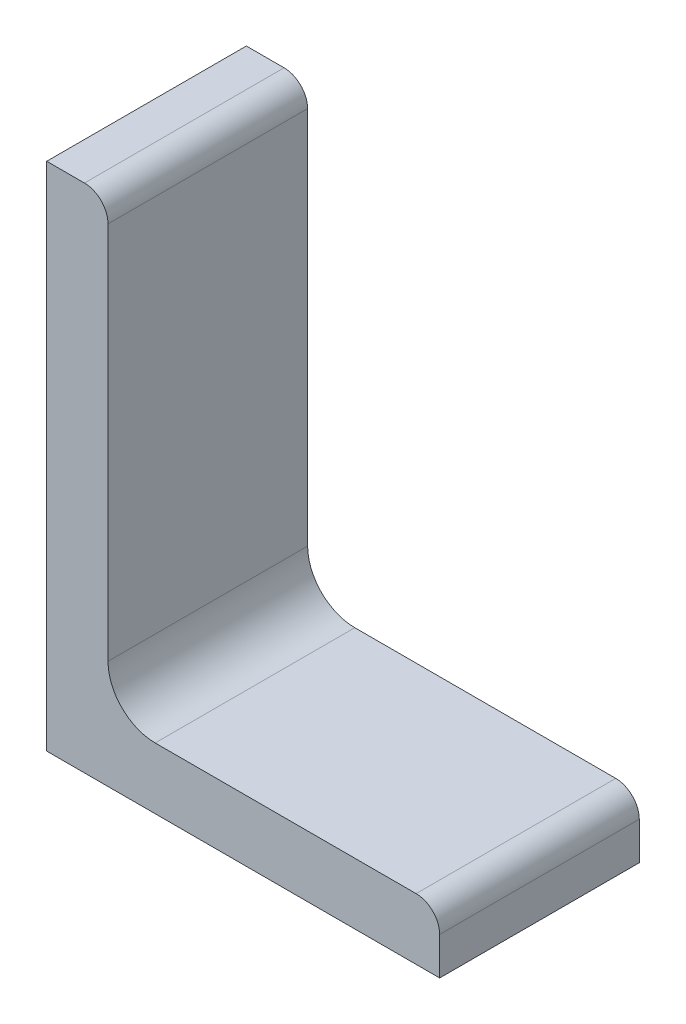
ISO-10303-21;
HEADER;
FILE_DESCRIPTION(('STEP AP214'),'2;1');
FILE_NAME('part.step','',(''),(''),'','','');
FILE_SCHEMA(('AUTOMOTIVE_DESIGN { 1 0 10303 214 1 1 1 1 }'));
ENDSEC;
DATA;
#1=APPLICATION_CONTEXT('core data for automotive mechanical design processes');
#2=APPLICATION_PROTOCOL_DEFINITION('international standard','automotive_design',2000,#1);
#3=PRODUCT_CONTEXT('',#1,'mechanical');
#4=PRODUCT('Part','Part','',(#3));
#5=PRODUCT_RELATED_PRODUCT_CATEGORY('part','',(#4));
#6=PRODUCT_DEFINITION_FORMATION('','',#4);
#7=PRODUCT_DEFINITION_CONTEXT('part definition',#1,'design');
#8=PRODUCT_DEFINITION('design','',#6,#7);
#9=PRODUCT_DEFINITION_SHAPE('','',#8);
#10=(LENGTH_UNIT() NAMED_UNIT(*) SI_UNIT(.MILLI.,.METRE.));
#11=(NAMED_UNIT(*) PLANE_ANGLE_UNIT() SI_UNIT($,.RADIAN.));
#12=(NAMED_UNIT(*) SI_UNIT($,.STERADIAN.) SOLID_ANGLE_UNIT());
#13=UNCERTAINTY_MEASURE_WITH_UNIT(LENGTH_MEASURE(1.E-05),#10,'distance_accuracy_value','');
#14=(GEOMETRIC_REPRESENTATION_CONTEXT(3) GLOBAL_UNCERTAINTY_ASSIGNED_CONTEXT((#13)) GLOBAL_UNIT_ASSIGNED_CONTEXT((#10,
#11,#12)) REPRESENTATION_CONTEXT('',''));
#15=CARTESIAN_POINT('',(0.,0.,0.));
#16=DIRECTION('',(0.,0.,1.));
#17=DIRECTION('',(1.,0.,0.));
#18=AXIS2_PLACEMENT_3D('',#15,#16,#17);
#19=CARTESIAN_POINT('',(0.,0.,12.7));
#20=DIRECTION('',(1.,0.,0.));
#21=DIRECTION('',(0.,0.,-1.));
#22=AXIS2_PLACEMENT_3D('',#19,#20,#21);
#23=PLANE('',#22);
#24=DIRECTION('',(0.,-1.,0.));
#25=VECTOR('',#24,1.);
#26=CARTESIAN_POINT('',(0.,0.,-12.7));
#27=LINE('',#26,#25);
#28=CARTESIAN_POINT('',(0.,65.,-12.7));
#29=VERTEX_POINT('',#28);
#30=CARTESIAN_POINT('',(0.,0.,-12.7));
#31=VERTEX_POINT('',#30);
#32=EDGE_CURVE('E134',#29,#31,#27,.T.);
#33=ORIENTED_EDGE('',*,*,#32,.T.);
#34=DIRECTION('',(0.,0.,-1.));
#35=VECTOR('',#34,1.);
#36=CARTESIAN_POINT('',(0.,0.,12.7));
#37=LINE('',#36,#35);
#38=CARTESIAN_POINT('',(0.,0.,12.7));
#39=VERTEX_POINT('',#38);
#40=EDGE_CURVE('E11',#39,#31,#37,.T.);
#41=ORIENTED_EDGE('',*,*,#40,.F.);
#42=DIRECTION('',(0.,-1.,0.));
#43=VECTOR('',#42,1.);
#44=CARTESIAN_POINT('',(0.,0.,12.7));
#45=LINE('',#44,#43);
#46=CARTESIAN_POINT('',(0.,65.,12.7));
#47=VERTEX_POINT('',#46);
#48=EDGE_CURVE('E150',#47,#39,#45,.T.);
#49=ORIENTED_EDGE('',*,*,#48,.F.);
#50=DIRECTION('',(0.,0.,-1.));
#51=VECTOR('',#50,1.);
#52=CARTESIAN_POINT('',(0.,65.,12.7));
#53=LINE('',#52,#51);
#54=EDGE_CURVE('E130',#47,#29,#53,.T.);
#55=ORIENTED_EDGE('',*,*,#54,.T.);
#56=EDGE_LOOP('',(#33,#41,#49,#55));
#57=FACE_BOUND('',#56,.T.);
#58=ADVANCED_FACE('F32',(#57),#23,.F.);
#59=CARTESIAN_POINT('',(0.,0.,12.7));
#60=DIRECTION('',(0.,1.,0.));
#61=DIRECTION('',(0.,0.,1.));
#62=AXIS2_PLACEMENT_3D('',#59,#60,#61);
#63=PLANE('',#62);
#64=DIRECTION('',(1.,0.,0.));
#65=VECTOR('',#64,1.);
#66=CARTESIAN_POINT('',(0.,0.,-12.7));
#67=LINE('',#66,#65);
#68=CARTESIAN_POINT('',(50.,0.,-12.7));
#69=VERTEX_POINT('',#68);
#70=EDGE_CURVE('E137',#31,#69,#67,.T.);
#71=ORIENTED_EDGE('',*,*,#70,.T.);
#72=DIRECTION('',(0.,0.,-1.));
#73=VECTOR('',#72,1.);
#74=CARTESIAN_POINT('',(50.,0.,12.7));
#75=LINE('',#74,#73);
#76=CARTESIAN_POINT('',(50.,0.,12.7));
#77=VERTEX_POINT('',#76);
#78=EDGE_CURVE('E40',#77,#69,#75,.T.);
#79=ORIENTED_EDGE('',*,*,#78,.F.);
#80=DIRECTION('',(1.,0.,0.));
#81=VECTOR('',#80,1.);
#82=CARTESIAN_POINT('',(0.,0.,12.7));
#83=LINE('',#82,#81);
#84=EDGE_CURVE('E94',#39,#77,#83,.T.);
#85=ORIENTED_EDGE('',*,*,#84,.F.);
#86=ORIENTED_EDGE('',*,*,#40,.T.);
#87=EDGE_LOOP('',(#71,#79,#85,#86));
#88=FACE_BOUND('',#87,.T.);
#89=ADVANCED_FACE('F193',(#88),#63,.F.);
#90=CARTESIAN_POINT('',(50.,0.,12.7));
#91=DIRECTION('',(-1.,0.,0.));
#92=DIRECTION('',(0.,0.,1.));
#93=AXIS2_PLACEMENT_3D('',#90,#91,#92);
#94=PLANE('',#93);
#95=DIRECTION('',(0.,1.,0.));
#96=VECTOR('',#95,1.);
#97=CARTESIAN_POINT('',(50.,0.,-12.7));
#98=LINE('',#97,#96);
#99=CARTESIAN_POINT('',(50.,4.8,-12.7));
#100=VERTEX_POINT('',#99);
#101=EDGE_CURVE('E139',#69,#100,#98,.T.);
#102=ORIENTED_EDGE('',*,*,#101,.T.);
#103=DIRECTION('',(0.,0.,-1.));
#104=VECTOR('',#103,1.);
#105=CARTESIAN_POINT('',(50.,4.8,12.7));
#106=LINE('',#105,#104);
#107=CARTESIAN_POINT('',(50.,4.8,12.7));
#108=VERTEX_POINT('',#107);
#109=EDGE_CURVE('E160',#108,#100,#106,.T.);
#110=ORIENTED_EDGE('',*,*,#109,.F.);
#111=DIRECTION('',(0.,1.,0.));
#112=VECTOR('',#111,1.);
#113=CARTESIAN_POINT('',(50.,0.,12.7));
#114=LINE('',#113,#112);
#115=EDGE_CURVE('E168',#77,#108,#114,.T.);
#116=ORIENTED_EDGE('',*,*,#115,.F.);
#117=ORIENTED_EDGE('',*,*,#78,.T.);
#118=EDGE_LOOP('',(#102,#110,#116,#117));
#119=FACE_BOUND('',#118,.T.);
#120=ADVANCED_FACE('F166',(#119),#94,.F.);
#121=CARTESIAN_POINT('',(47.,4.8,12.7));
#122=DIRECTION('',(0.,0.,-1.));
#123=DIRECTION('',(-1.,0.,0.));
#124=AXIS2_PLACEMENT_3D('',#121,#122,#123);
#125=CYLINDRICAL_SURFACE('',#124,3.);
#126=CARTESIAN_POINT('',(47.,4.8,-12.7));
#127=DIRECTION('',(0.,0.,1.));
#128=DIRECTION('',(1.,0.,0.));
#129=AXIS2_PLACEMENT_3D('',#126,#127,#128);
#130=CIRCLE('',#129,3.);
#131=CARTESIAN_POINT('',(47.,7.8,-12.7));
#132=VERTEX_POINT('',#131);
#133=EDGE_CURVE('E141',#100,#132,#130,.T.);
#134=ORIENTED_EDGE('',*,*,#133,.T.);
#135=DIRECTION('',(0.,0.,-1.));
#136=VECTOR('',#135,1.);
#137=CARTESIAN_POINT('',(47.,7.8,12.7));
#138=LINE('',#137,#136);
#139=CARTESIAN_POINT('',(47.,7.8,12.7));
#140=VERTEX_POINT('',#139);
#141=EDGE_CURVE('E157',#140,#132,#138,.T.);
#142=ORIENTED_EDGE('',*,*,#141,.F.);
#143=CARTESIAN_POINT('',(47.,4.8,12.7));
#144=DIRECTION('',(0.,0.,1.));
#145=DIRECTION('',(1.,0.,0.));
#146=AXIS2_PLACEMENT_3D('',#143,#144,#145);
#147=CIRCLE('',#146,3.);
#148=EDGE_CURVE('E184',#108,#140,#147,.T.);
#149=ORIENTED_EDGE('',*,*,#148,.F.);
#150=ORIENTED_EDGE('',*,*,#109,.T.);
#151=EDGE_LOOP('',(#134,#142,#149,#150));
#152=FACE_BOUND('',#151,.T.);
#153=ADVANCED_FACE('F177',(#152),#125,.T.);
#154=CARTESIAN_POINT('',(13.8,7.8,12.7));
#155=DIRECTION('',(0.,-1.,0.));
#156=DIRECTION('',(1.,0.,0.));
#157=AXIS2_PLACEMENT_3D('',#154,#155,#156);
#158=PLANE('',#157);
#159=DIRECTION('',(-1.,0.,0.));
#160=VECTOR('',#159,1.);
#161=CARTESIAN_POINT('',(13.8,7.8,-12.7));
#162=LINE('',#161,#160);
#163=CARTESIAN_POINT('',(13.8,7.8,-12.7));
#164=VERTEX_POINT('',#163);
#165=EDGE_CURVE('E143',#132,#164,#162,.T.);
#166=ORIENTED_EDGE('',*,*,#165,.T.);
#167=DIRECTION('',(0.,0.,-1.));
#168=VECTOR('',#167,1.);
#169=CARTESIAN_POINT('',(13.8,7.8,12.7));
#170=LINE('',#169,#168);
#171=CARTESIAN_POINT('',(13.8,7.8,12.7));
#172=VERTEX_POINT('',#171);
#173=EDGE_CURVE('E154',#172,#164,#170,.T.);
#174=ORIENTED_EDGE('',*,*,#173,.F.);
#175=DIRECTION('',(-1.,0.,0.));
#176=VECTOR('',#175,1.);
#177=CARTESIAN_POINT('',(13.8,7.8,12.7));
#178=LINE('',#177,#176);
#179=EDGE_CURVE('E183',#140,#172,#178,.T.);
#180=ORIENTED_EDGE('',*,*,#179,.F.);
#181=ORIENTED_EDGE('',*,*,#141,.T.);
#182=EDGE_LOOP('',(#166,#174,#180,#181));
#183=FACE_BOUND('',#182,.T.);
#184=ADVANCED_FACE('F181',(#183),#158,.F.);
#185=CARTESIAN_POINT('',(13.8,13.8,12.7));
#186=DIRECTION('',(0.,0.,-1.));
#187=DIRECTION('',(-1.,0.,0.));
#188=AXIS2_PLACEMENT_3D('',#185,#186,#187);
#189=CYLINDRICAL_SURFACE('',#188,6.);
#190=CARTESIAN_POINT('',(13.8,13.8,-12.7));
#191=DIRECTION('',(0.,0.,-1.));
#192=DIRECTION('',(1.,0.,0.));
#193=AXIS2_PLACEMENT_3D('',#190,#191,#192);
#194=CIRCLE('',#193,6.);
#195=CARTESIAN_POINT('',(7.80000000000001,13.8,-12.7));
#196=VERTEX_POINT('',#195);
#197=EDGE_CURVE('E145',#164,#196,#194,.T.);
#198=ORIENTED_EDGE('',*,*,#197,.T.);
#199=DIRECTION('',(0.,0.,-1.));
#200=VECTOR('',#199,1.);
#201=CARTESIAN_POINT('',(7.80000000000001,13.8,12.7));
#202=LINE('',#201,#200);
#203=CARTESIAN_POINT('',(7.80000000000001,13.8,12.7));
#204=VERTEX_POINT('',#203);
#205=EDGE_CURVE('E125',#204,#196,#202,.T.);
#206=ORIENTED_EDGE('',*,*,#205,.F.);
#207=CARTESIAN_POINT('',(13.8,13.8,12.7));
#208=DIRECTION('',(0.,0.,-1.));
#209=DIRECTION('',(1.,0.,0.));
#210=AXIS2_PLACEMENT_3D('',#207,#208,#209);
#211=CIRCLE('',#210,6.);
#212=EDGE_CURVE('E116',#172,#204,#211,.T.);
#213=ORIENTED_EDGE('',*,*,#212,.F.);
#214=ORIENTED_EDGE('',*,*,#173,.T.);
#215=EDGE_LOOP('',(#198,#206,#213,#214));
#216=FACE_BOUND('',#215,.T.);
#217=ADVANCED_FACE('F205',(#216),#189,.F.);
#218=CARTESIAN_POINT('',(7.8,62.,12.7));
#219=DIRECTION('',(-1.,0.,0.));
#220=DIRECTION('',(0.,-1.,0.));
#221=AXIS2_PLACEMENT_3D('',#218,#219,#220);
#222=PLANE('',#221);
#223=DIRECTION('',(0.,1.,0.));
#224=VECTOR('',#223,1.);
#225=CARTESIAN_POINT('',(7.8,62.,-12.7));
#226=LINE('',#225,#224);
#227=CARTESIAN_POINT('',(7.8,62.,-12.7));
#228=VERTEX_POINT('',#227);
#229=EDGE_CURVE('E124',#196,#228,#226,.T.);
#230=ORIENTED_EDGE('',*,*,#229,.T.);
#231=DIRECTION('',(0.,0.,-1.));
#232=VECTOR('',#231,1.);
#233=CARTESIAN_POINT('',(7.8,62.,12.7));
#234=LINE('',#233,#232);
#235=CARTESIAN_POINT('',(7.8,62.,12.7));
#236=VERTEX_POINT('',#235);
#237=EDGE_CURVE('E121',#236,#228,#234,.T.);
#238=ORIENTED_EDGE('',*,*,#237,.F.);
#239=DIRECTION('',(0.,1.,0.));
#240=VECTOR('',#239,1.);
#241=CARTESIAN_POINT('',(7.8,62.,12.7));
#242=LINE('',#241,#240);
#243=EDGE_CURVE('E110',#204,#236,#242,.T.);
#244=ORIENTED_EDGE('',*,*,#243,.F.);
#245=ORIENTED_EDGE('',*,*,#205,.T.);
#246=EDGE_LOOP('',(#230,#238,#244,#245));
#247=FACE_BOUND('',#246,.T.);
#248=ADVANCED_FACE('F122',(#247),#222,.F.);
#249=CARTESIAN_POINT('',(4.8,62.,12.7));
#250=DIRECTION('',(0.,0.,-1.));
#251=DIRECTION('',(-1.,0.,0.));
#252=AXIS2_PLACEMENT_3D('',#249,#250,#251);
#253=CYLINDRICAL_SURFACE('',#252,2.99999999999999);
#254=CARTESIAN_POINT('',(4.8,62.,-12.7));
#255=DIRECTION('',(0.,0.,1.));
#256=DIRECTION('',(-1.,0.,0.));
#257=AXIS2_PLACEMENT_3D('',#254,#255,#256);
#258=CIRCLE('',#257,2.99999999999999);
#259=CARTESIAN_POINT('',(4.8,65.,-12.7));
#260=VERTEX_POINT('',#259);
#261=EDGE_CURVE('E80',#228,#260,#258,.T.);
#262=ORIENTED_EDGE('',*,*,#261,.T.);
#263=DIRECTION('',(0.,0.,-1.));
#264=VECTOR('',#263,1.);
#265=CARTESIAN_POINT('',(4.8,65.,12.7));
#266=LINE('',#265,#264);
#267=CARTESIAN_POINT('',(4.8,65.,12.7));
#268=VERTEX_POINT('',#267);
#269=EDGE_CURVE('E126',#268,#260,#266,.T.);
#270=ORIENTED_EDGE('',*,*,#269,.F.);
#271=CARTESIAN_POINT('',(4.8,62.,12.7));
#272=DIRECTION('',(0.,0.,1.));
#273=DIRECTION('',(-1.,0.,0.));
#274=AXIS2_PLACEMENT_3D('',#271,#272,#273);
#275=CIRCLE('',#274,2.99999999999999);
#276=EDGE_CURVE('E114',#236,#268,#275,.T.);
#277=ORIENTED_EDGE('',*,*,#276,.F.);
#278=ORIENTED_EDGE('',*,*,#237,.T.);
#279=EDGE_LOOP('',(#262,#270,#277,#278));
#280=FACE_BOUND('',#279,.T.);
#281=ADVANCED_FACE('F128',(#280),#253,.T.);
#282=CARTESIAN_POINT('',(0.,65.,12.7));
#283=DIRECTION('',(0.,-1.,0.));
#284=DIRECTION('',(0.,0.,-1.));
#285=AXIS2_PLACEMENT_3D('',#282,#283,#284);
#286=PLANE('',#285);
#287=DIRECTION('',(-1.,0.,0.));
#288=VECTOR('',#287,1.);
#289=CARTESIAN_POINT('',(0.,65.,-12.7));
#290=LINE('',#289,#288);
#291=EDGE_CURVE('E86',#260,#29,#290,.T.);
#292=ORIENTED_EDGE('',*,*,#291,.T.);
#293=ORIENTED_EDGE('',*,*,#54,.F.);
#294=DIRECTION('',(-1.,0.,0.));
#295=VECTOR('',#294,1.);
#296=CARTESIAN_POINT('',(0.,65.,12.7));
#297=LINE('',#296,#295);
#298=EDGE_CURVE('E48',#268,#47,#297,.T.);
#299=ORIENTED_EDGE('',*,*,#298,.F.);
#300=ORIENTED_EDGE('',*,*,#269,.T.);
#301=EDGE_LOOP('',(#292,#293,#299,#300));
#302=FACE_BOUND('',#301,.T.);
#303=ADVANCED_FACE('F213',(#302),#286,.F.);
#304=CARTESIAN_POINT('',(4.8,62.,12.7));
#305=DIRECTION('',(0.,0.,-1.));
#306=DIRECTION('',(-1.,0.,0.));
#307=AXIS2_PLACEMENT_3D('',#304,#305,#306);
#308=PLANE('',#307);
#309=ORIENTED_EDGE('',*,*,#48,.T.);
#310=ORIENTED_EDGE('',*,*,#84,.T.);
#311=ORIENTED_EDGE('',*,*,#115,.T.);
#312=ORIENTED_EDGE('',*,*,#148,.T.);
#313=ORIENTED_EDGE('',*,*,#179,.T.);
#314=ORIENTED_EDGE('',*,*,#212,.T.);
#315=ORIENTED_EDGE('',*,*,#243,.T.);
#316=ORIENTED_EDGE('',*,*,#276,.T.);
#317=ORIENTED_EDGE('',*,*,#298,.T.);
#318=EDGE_LOOP('',(#309,#310,#311,#312,#313,#314,#315,#316,#317));
#319=FACE_BOUND('',#318,.T.);
#320=ADVANCED_FACE('F112',(#319),#308,.F.);
#321=CARTESIAN_POINT('',(4.8,62.,-12.7));
#322=DIRECTION('',(0.,0.,-1.));
#323=DIRECTION('',(-1.,0.,0.));
#324=AXIS2_PLACEMENT_3D('',#321,#322,#323);
#325=PLANE('',#324);
#326=ORIENTED_EDGE('',*,*,#32,.F.);
#327=ORIENTED_EDGE('',*,*,#291,.F.);
#328=ORIENTED_EDGE('',*,*,#261,.F.);
#329=ORIENTED_EDGE('',*,*,#229,.F.);
#330=ORIENTED_EDGE('',*,*,#197,.F.);
#331=ORIENTED_EDGE('',*,*,#165,.F.);
#332=ORIENTED_EDGE('',*,*,#133,.F.);
#333=ORIENTED_EDGE('',*,*,#101,.F.);
#334=ORIENTED_EDGE('',*,*,#70,.F.);
#335=EDGE_LOOP('',(#326,#327,#328,#329,#330,#331,#332,#333,#334));
#336=FACE_BOUND('',#335,.T.);
#337=ADVANCED_FACE('F172',(#336),#325,.T.);
#338=CLOSED_SHELL('',(#58,#89,#120,#153,#184,#217,#248,#281,#303,#320,#337));
#339=MANIFOLD_SOLID_BREP('B2',#338);
#340=ADVANCED_BREP_SHAPE_REPRESENTATION('',(#18,#339),#14);
#341=SHAPE_DEFINITION_REPRESENTATION(#9,#340);
ENDSEC;
END-ISO-10303-21;
